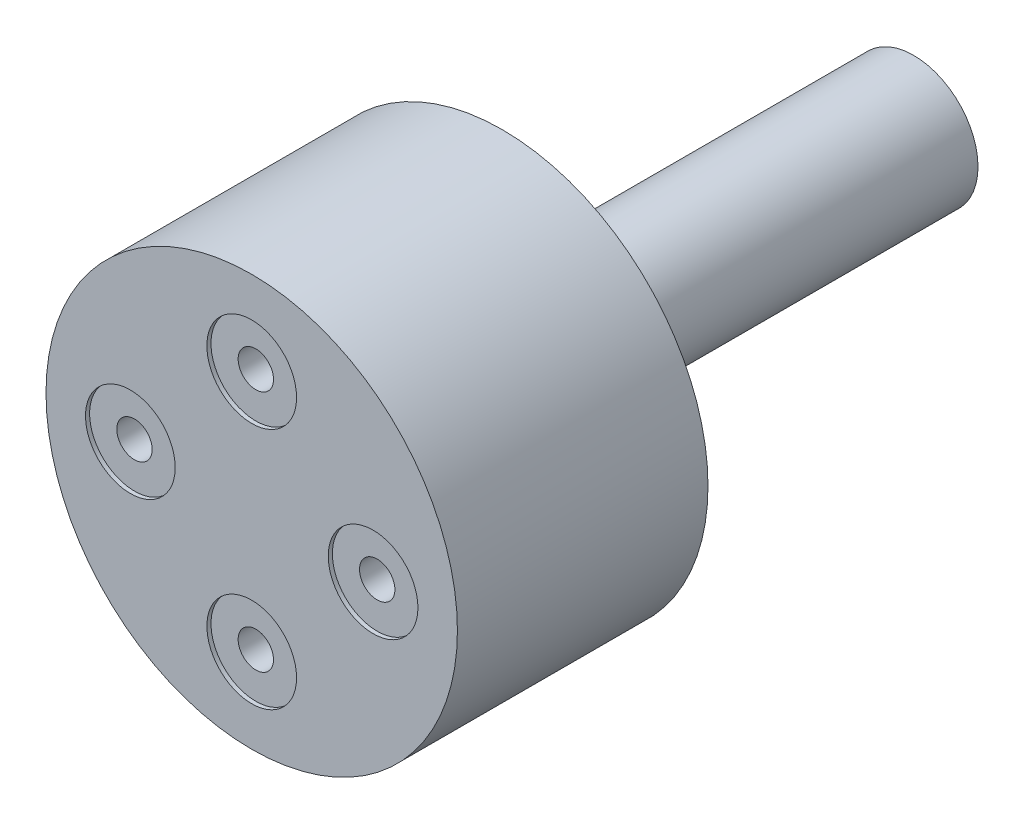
ISO-10303-21;
HEADER;
FILE_DESCRIPTION(('STEP AP214'),'2;1');
FILE_NAME('part.step','',(''),(''),'','','');
FILE_SCHEMA(('AUTOMOTIVE_DESIGN { 1 0 10303 214 1 1 1 1 }'));
ENDSEC;
DATA;
#1=APPLICATION_CONTEXT('core data for automotive mechanical design processes');
#2=APPLICATION_PROTOCOL_DEFINITION('international standard','automotive_design',2000,#1);
#3=PRODUCT_CONTEXT('',#1,'mechanical');
#4=PRODUCT('Part','Part','',(#3));
#5=PRODUCT_RELATED_PRODUCT_CATEGORY('part','',(#4));
#6=PRODUCT_DEFINITION_FORMATION('','',#4);
#7=PRODUCT_DEFINITION_CONTEXT('part definition',#1,'design');
#8=PRODUCT_DEFINITION('design','',#6,#7);
#9=PRODUCT_DEFINITION_SHAPE('','',#8);
#10=(LENGTH_UNIT() NAMED_UNIT(*) SI_UNIT(.MILLI.,.METRE.));
#11=(NAMED_UNIT(*) PLANE_ANGLE_UNIT() SI_UNIT($,.RADIAN.));
#12=(NAMED_UNIT(*) SI_UNIT($,.STERADIAN.) SOLID_ANGLE_UNIT());
#13=UNCERTAINTY_MEASURE_WITH_UNIT(LENGTH_MEASURE(1.E-05),#10,'distance_accuracy_value','');
#14=(GEOMETRIC_REPRESENTATION_CONTEXT(3) GLOBAL_UNCERTAINTY_ASSIGNED_CONTEXT((#13)) GLOBAL_UNIT_ASSIGNED_CONTEXT((#10,
#11,#12)) REPRESENTATION_CONTEXT('',''));
#15=CARTESIAN_POINT('',(0.,0.,0.));
#16=DIRECTION('',(0.,0.,1.));
#17=DIRECTION('',(1.,0.,0.));
#18=AXIS2_PLACEMENT_3D('',#15,#16,#17);
#19=CARTESIAN_POINT('',(0.360795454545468,0.,-20.4343));
#20=DIRECTION('',(0.,0.,1.));
#21=DIRECTION('',(1.,0.,0.));
#22=AXIS2_PLACEMENT_3D('',#19,#20,#21);
#23=PLANE('',#22);
#24=CARTESIAN_POINT('',(0.,0.,-20.4343));
#25=DIRECTION('',(0.,0.,1.));
#26=DIRECTION('',(1.,0.,0.));
#27=AXIS2_PLACEMENT_3D('',#24,#25,#26);
#28=CIRCLE('',#27,3.96875);
#29=CARTESIAN_POINT('',(3.96875,0.,-20.4343));
#30=VERTEX_POINT('',#29);
#31=EDGE_CURVE('E52',#30,#30,#28,.T.);
#32=ORIENTED_EDGE('',*,*,#31,.F.);
#33=EDGE_LOOP('',(#32));
#34=FACE_BOUND('',#33,.T.);
#35=ADVANCED_FACE('F31',(#34),#23,.F.);
#36=CARTESIAN_POINT('',(0.,0.,-20.4343));
#37=DIRECTION('',(0.,0.,1.));
#38=DIRECTION('',(1.,0.,0.));
#39=AXIS2_PLACEMENT_3D('',#36,#37,#38);
#40=CYLINDRICAL_SURFACE('',#39,3.96875);
#41=ORIENTED_EDGE('',*,*,#31,.T.);
#42=EDGE_LOOP('',(#41));
#43=FACE_BOUND('',#42,.T.);
#44=CARTESIAN_POINT('',(0.,0.,4.96569999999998));
#45=DIRECTION('',(0.,0.,1.));
#46=DIRECTION('',(1.,0.,0.));
#47=AXIS2_PLACEMENT_3D('',#44,#45,#46);
#48=CIRCLE('',#47,3.96875);
#49=CARTESIAN_POINT('',(3.96875,0.,4.96569999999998));
#50=VERTEX_POINT('',#49);
#51=EDGE_CURVE('E44',#50,#50,#48,.F.);
#52=ORIENTED_EDGE('',*,*,#51,.T.);
#53=EDGE_LOOP('',(#52));
#54=FACE_BOUND('',#53,.T.);
#55=ADVANCED_FACE('F124',(#43,#54),#40,.T.);
#56=CARTESIAN_POINT('',(1.15454545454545,0.,20.4343));
#57=DIRECTION('',(0.,0.,1.));
#58=DIRECTION('',(1.,0.,0.));
#59=AXIS2_PLACEMENT_3D('',#56,#57,#58);
#60=PLANE('',#59);
#61=CARTESIAN_POINT('',(7.493,0.,20.4343));
#62=DIRECTION('',(0.,0.,1.));
#63=DIRECTION('',(1.,0.,0.));
#64=AXIS2_PLACEMENT_3D('',#61,#62,#63);
#65=CIRCLE('',#64,2.7686);
#66=CARTESIAN_POINT('',(10.2616,0.,20.4343));
#67=VERTEX_POINT('',#66);
#68=EDGE_CURVE('E80',#67,#67,#65,.T.);
#69=ORIENTED_EDGE('',*,*,#68,.F.);
#70=EDGE_LOOP('',(#69));
#71=FACE_BOUND('',#70,.T.);
#72=CARTESIAN_POINT('',(0.,-7.493,20.4343));
#73=DIRECTION('',(0.,0.,1.));
#74=DIRECTION('',(1.,0.,0.));
#75=AXIS2_PLACEMENT_3D('',#72,#73,#74);
#76=CIRCLE('',#75,2.7686);
#77=CARTESIAN_POINT('',(2.7686,-7.493,20.4343));
#78=VERTEX_POINT('',#77);
#79=EDGE_CURVE('E73',#78,#78,#76,.T.);
#80=ORIENTED_EDGE('',*,*,#79,.F.);
#81=EDGE_LOOP('',(#80));
#82=FACE_BOUND('',#81,.T.);
#83=CARTESIAN_POINT('',(-7.493,0.,20.4343));
#84=DIRECTION('',(0.,0.,1.));
#85=DIRECTION('',(1.,0.,0.));
#86=AXIS2_PLACEMENT_3D('',#83,#84,#85);
#87=CIRCLE('',#86,2.7686);
#88=CARTESIAN_POINT('',(-4.7244,0.,20.4343));
#89=VERTEX_POINT('',#88);
#90=EDGE_CURVE('E66',#89,#89,#87,.T.);
#91=ORIENTED_EDGE('',*,*,#90,.F.);
#92=EDGE_LOOP('',(#91));
#93=FACE_BOUND('',#92,.T.);
#94=CARTESIAN_POINT('',(0.,7.493,20.4343));
#95=DIRECTION('',(0.,0.,1.));
#96=DIRECTION('',(1.,0.,0.));
#97=AXIS2_PLACEMENT_3D('',#94,#95,#96);
#98=CIRCLE('',#97,2.7686);
#99=CARTESIAN_POINT('',(2.7686,7.493,20.4343));
#100=VERTEX_POINT('',#99);
#101=EDGE_CURVE('E62',#100,#100,#98,.T.);
#102=ORIENTED_EDGE('',*,*,#101,.F.);
#103=EDGE_LOOP('',(#102));
#104=FACE_BOUND('',#103,.T.);
#105=CARTESIAN_POINT('',(0.,0.,20.4343));
#106=DIRECTION('',(0.,0.,-1.));
#107=DIRECTION('',(-1.,0.,0.));
#108=AXIS2_PLACEMENT_3D('',#105,#106,#107);
#109=CIRCLE('',#108,12.7);
#110=CARTESIAN_POINT('',(-12.7,0.,20.4343));
#111=VERTEX_POINT('',#110);
#112=EDGE_CURVE('E39',#111,#111,#109,.T.);
#113=ORIENTED_EDGE('',*,*,#112,.F.);
#114=EDGE_LOOP('',(#113));
#115=FACE_BOUND('',#114,.T.);
#116=ADVANCED_FACE('F130',(#71,#82,#93,#104,#115),#60,.T.);
#117=CARTESIAN_POINT('',(1.15454545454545,0.,4.96569999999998));
#118=DIRECTION('',(0.,0.,1.));
#119=DIRECTION('',(1.,0.,0.));
#120=AXIS2_PLACEMENT_3D('',#117,#118,#119);
#121=PLANE('',#120);
#122=ORIENTED_EDGE('',*,*,#51,.F.);
#123=EDGE_LOOP('',(#122));
#124=FACE_BOUND('',#123,.T.);
#125=CARTESIAN_POINT('',(0.,0.,4.9657));
#126=DIRECTION('',(0.,0.,-1.));
#127=DIRECTION('',(-1.,0.,0.));
#128=AXIS2_PLACEMENT_3D('',#125,#126,#127);
#129=CIRCLE('',#128,12.7);
#130=CARTESIAN_POINT('',(-12.7,0.,4.9657));
#131=VERTEX_POINT('',#130);
#132=EDGE_CURVE('E10',#131,#131,#129,.F.);
#133=ORIENTED_EDGE('',*,*,#132,.F.);
#134=EDGE_LOOP('',(#133));
#135=FACE_BOUND('',#134,.T.);
#136=ADVANCED_FACE('F120',(#124,#135),#121,.F.);
#137=CARTESIAN_POINT('',(0.,0.,20.4343));
#138=DIRECTION('',(0.,0.,-1.));
#139=DIRECTION('',(-1.,0.,0.));
#140=AXIS2_PLACEMENT_3D('',#137,#138,#139);
#141=CYLINDRICAL_SURFACE('',#140,12.7);
#142=ORIENTED_EDGE('',*,*,#112,.T.);
#143=EDGE_LOOP('',(#142));
#144=FACE_BOUND('',#143,.T.);
#145=ORIENTED_EDGE('',*,*,#132,.T.);
#146=EDGE_LOOP('',(#145));
#147=FACE_BOUND('',#146,.T.);
#148=ADVANCED_FACE('F33',(#144,#147),#141,.T.);
#149=CARTESIAN_POINT('',(0.,7.493,20.1803));
#150=DIRECTION('',(0.,0.,1.));
#151=DIRECTION('',(1.,0.,0.));
#152=AXIS2_PLACEMENT_3D('',#149,#150,#151);
#153=PLANE('',#152);
#154=CARTESIAN_POINT('',(0.,7.493,20.1803));
#155=DIRECTION('',(0.,0.,1.));
#156=DIRECTION('',(1.,0.,0.));
#157=AXIS2_PLACEMENT_3D('',#154,#155,#156);
#158=CIRCLE('',#157,2.7686);
#159=CARTESIAN_POINT('',(2.7686,7.493,20.1803));
#160=VERTEX_POINT('',#159);
#161=EDGE_CURVE('E59',#160,#160,#158,.T.);
#162=ORIENTED_EDGE('',*,*,#161,.T.);
#163=EDGE_LOOP('',(#162));
#164=FACE_BOUND('',#163,.T.);
#165=CARTESIAN_POINT('',(0.,7.493,20.1803));
#166=DIRECTION('',(0.,0.,1.));
#167=DIRECTION('',(1.,0.,0.));
#168=AXIS2_PLACEMENT_3D('',#165,#166,#167);
#169=CIRCLE('',#168,1.0922);
#170=CARTESIAN_POINT('',(1.0922,7.493,20.1803));
#171=VERTEX_POINT('',#170);
#172=EDGE_CURVE('E55',#171,#171,#169,.F.);
#173=ORIENTED_EDGE('',*,*,#172,.T.);
#174=EDGE_LOOP('',(#173));
#175=FACE_BOUND('',#174,.T.);
#176=ADVANCED_FACE('F109',(#164,#175),#153,.T.);
#177=CARTESIAN_POINT('',(0.,7.493,20.1803));
#178=DIRECTION('',(0.,0.,1.));
#179=DIRECTION('',(1.,0.,0.));
#180=AXIS2_PLACEMENT_3D('',#177,#178,#179);
#181=CYLINDRICAL_SURFACE('',#180,2.7686);
#182=ORIENTED_EDGE('',*,*,#161,.F.);
#183=EDGE_LOOP('',(#182));
#184=FACE_BOUND('',#183,.T.);
#185=ORIENTED_EDGE('',*,*,#101,.T.);
#186=EDGE_LOOP('',(#185));
#187=FACE_BOUND('',#186,.T.);
#188=ADVANCED_FACE('F111',(#184,#187),#181,.F.);
#189=CARTESIAN_POINT('',(0.,7.493,14.0843));
#190=DIRECTION('',(0.,0.,1.));
#191=DIRECTION('',(1.,0.,0.));
#192=AXIS2_PLACEMENT_3D('',#189,#190,#191);
#193=PLANE('',#192);
#194=CARTESIAN_POINT('',(0.,7.493,14.0843));
#195=DIRECTION('',(0.,0.,1.));
#196=DIRECTION('',(1.,0.,0.));
#197=AXIS2_PLACEMENT_3D('',#194,#195,#196);
#198=CIRCLE('',#197,1.0922);
#199=CARTESIAN_POINT('',(1.0922,7.493,14.0843));
#200=VERTEX_POINT('',#199);
#201=EDGE_CURVE('E47',#200,#200,#198,.T.);
#202=ORIENTED_EDGE('',*,*,#201,.T.);
#203=EDGE_LOOP('',(#202));
#204=FACE_BOUND('',#203,.T.);
#205=ADVANCED_FACE('F100',(#204),#193,.T.);
#206=CARTESIAN_POINT('',(0.,7.493,14.0843));
#207=DIRECTION('',(0.,0.,1.));
#208=DIRECTION('',(1.,0.,0.));
#209=AXIS2_PLACEMENT_3D('',#206,#207,#208);
#210=CYLINDRICAL_SURFACE('',#209,1.0922);
#211=ORIENTED_EDGE('',*,*,#201,.F.);
#212=EDGE_LOOP('',(#211));
#213=FACE_BOUND('',#212,.T.);
#214=ORIENTED_EDGE('',*,*,#172,.F.);
#215=EDGE_LOOP('',(#214));
#216=FACE_BOUND('',#215,.T.);
#217=ADVANCED_FACE('F102',(#213,#216),#210,.F.);
#218=CARTESIAN_POINT('',(-7.493,0.,20.1803));
#219=DIRECTION('',(0.,0.,1.));
#220=DIRECTION('',(1.,0.,0.));
#221=AXIS2_PLACEMENT_3D('',#218,#219,#220);
#222=PLANE('',#221);
#223=CARTESIAN_POINT('',(-7.493,0.,20.1803));
#224=DIRECTION('',(0.,0.,1.));
#225=DIRECTION('',(1.,0.,0.));
#226=AXIS2_PLACEMENT_3D('',#223,#224,#225);
#227=CIRCLE('',#226,2.7686);
#228=CARTESIAN_POINT('',(-4.7244,0.,20.1803));
#229=VERTEX_POINT('',#228);
#230=EDGE_CURVE('E63',#229,#229,#227,.T.);
#231=ORIENTED_EDGE('',*,*,#230,.T.);
#232=EDGE_LOOP('',(#231));
#233=FACE_BOUND('',#232,.T.);
#234=CARTESIAN_POINT('',(-7.493,0.,20.1803));
#235=DIRECTION('',(0.,0.,1.));
#236=DIRECTION('',(1.,0.,0.));
#237=AXIS2_PLACEMENT_3D('',#234,#235,#236);
#238=CIRCLE('',#237,1.0922);
#239=CARTESIAN_POINT('',(-6.4008,0.,20.1803));
#240=VERTEX_POINT('',#239);
#241=EDGE_CURVE('E60',#240,#240,#238,.F.);
#242=ORIENTED_EDGE('',*,*,#241,.T.);
#243=EDGE_LOOP('',(#242));
#244=FACE_BOUND('',#243,.T.);
#245=ADVANCED_FACE('F105',(#233,#244),#222,.T.);
#246=CARTESIAN_POINT('',(-7.493,0.,20.1803));
#247=DIRECTION('',(0.,0.,1.));
#248=DIRECTION('',(1.,0.,0.));
#249=AXIS2_PLACEMENT_3D('',#246,#247,#248);
#250=CYLINDRICAL_SURFACE('',#249,2.7686);
#251=ORIENTED_EDGE('',*,*,#230,.F.);
#252=EDGE_LOOP('',(#251));
#253=FACE_BOUND('',#252,.T.);
#254=ORIENTED_EDGE('',*,*,#90,.T.);
#255=EDGE_LOOP('',(#254));
#256=FACE_BOUND('',#255,.T.);
#257=ADVANCED_FACE('F200',(#253,#256),#250,.F.);
#258=CARTESIAN_POINT('',(-7.493,0.,14.0843));
#259=DIRECTION('',(0.,0.,-1.));
#260=DIRECTION('',(-1.,0.,0.));
#261=AXIS2_PLACEMENT_3D('',#258,#259,#260);
#262=PLANE('',#261);
#263=CARTESIAN_POINT('',(-7.493,0.,14.0843));
#264=DIRECTION('',(0.,0.,1.));
#265=DIRECTION('',(-1.,0.,0.));
#266=AXIS2_PLACEMENT_3D('',#263,#264,#265);
#267=CIRCLE('',#266,1.0922);
#268=CARTESIAN_POINT('',(-8.5852,0.,14.0843));
#269=VERTEX_POINT('',#268);
#270=EDGE_CURVE('E58',#269,#269,#267,.T.);
#271=ORIENTED_EDGE('',*,*,#270,.T.);
#272=EDGE_LOOP('',(#271));
#273=FACE_BOUND('',#272,.T.);
#274=ADVANCED_FACE('F196',(#273),#262,.F.);
#275=CARTESIAN_POINT('',(-7.493,0.,14.0843));
#276=DIRECTION('',(0.,0.,1.));
#277=DIRECTION('',(1.,0.,0.));
#278=AXIS2_PLACEMENT_3D('',#275,#276,#277);
#279=CYLINDRICAL_SURFACE('',#278,1.0922);
#280=ORIENTED_EDGE('',*,*,#270,.F.);
#281=EDGE_LOOP('',(#280));
#282=FACE_BOUND('',#281,.T.);
#283=ORIENTED_EDGE('',*,*,#241,.F.);
#284=EDGE_LOOP('',(#283));
#285=FACE_BOUND('',#284,.T.);
#286=ADVANCED_FACE('F199',(#282,#285),#279,.F.);
#287=CARTESIAN_POINT('',(0.,-7.493,20.1803));
#288=DIRECTION('',(0.,0.,1.));
#289=DIRECTION('',(1.,0.,0.));
#290=AXIS2_PLACEMENT_3D('',#287,#288,#289);
#291=PLANE('',#290);
#292=CARTESIAN_POINT('',(0.,-7.493,20.1803));
#293=DIRECTION('',(0.,0.,1.));
#294=DIRECTION('',(1.,0.,0.));
#295=AXIS2_PLACEMENT_3D('',#292,#293,#294);
#296=CIRCLE('',#295,2.7686);
#297=CARTESIAN_POINT('',(2.7686,-7.493,20.1803));
#298=VERTEX_POINT('',#297);
#299=EDGE_CURVE('E67',#298,#298,#296,.T.);
#300=ORIENTED_EDGE('',*,*,#299,.T.);
#301=EDGE_LOOP('',(#300));
#302=FACE_BOUND('',#301,.T.);
#303=CARTESIAN_POINT('',(0.,-7.493,20.1803));
#304=DIRECTION('',(0.,0.,1.));
#305=DIRECTION('',(1.,0.,0.));
#306=AXIS2_PLACEMENT_3D('',#303,#304,#305);
#307=CIRCLE('',#306,1.0922);
#308=CARTESIAN_POINT('',(1.0922,-7.493,20.1803));
#309=VERTEX_POINT('',#308);
#310=EDGE_CURVE('E64',#309,#309,#307,.F.);
#311=ORIENTED_EDGE('',*,*,#310,.T.);
#312=EDGE_LOOP('',(#311));
#313=FACE_BOUND('',#312,.T.);
#314=ADVANCED_FACE('F250',(#302,#313),#291,.T.);
#315=CARTESIAN_POINT('',(0.,-7.493,20.1803));
#316=DIRECTION('',(0.,0.,1.));
#317=DIRECTION('',(1.,0.,0.));
#318=AXIS2_PLACEMENT_3D('',#315,#316,#317);
#319=CYLINDRICAL_SURFACE('',#318,2.7686);
#320=ORIENTED_EDGE('',*,*,#299,.F.);
#321=EDGE_LOOP('',(#320));
#322=FACE_BOUND('',#321,.T.);
#323=ORIENTED_EDGE('',*,*,#79,.T.);
#324=EDGE_LOOP('',(#323));
#325=FACE_BOUND('',#324,.T.);
#326=ADVANCED_FACE('F187',(#322,#325),#319,.F.);
#327=CARTESIAN_POINT('',(0.,-7.493,14.0843));
#328=DIRECTION('',(0.,0.,-1.));
#329=DIRECTION('',(-1.,0.,0.));
#330=AXIS2_PLACEMENT_3D('',#327,#328,#329);
#331=PLANE('',#330);
#332=CARTESIAN_POINT('',(0.,-7.493,14.0843));
#333=DIRECTION('',(0.,0.,1.));
#334=DIRECTION('',(-1.,0.,0.));
#335=AXIS2_PLACEMENT_3D('',#332,#333,#334);
#336=CIRCLE('',#335,1.0922);
#337=CARTESIAN_POINT('',(-1.0922,-7.493,14.0843));
#338=VERTEX_POINT('',#337);
#339=EDGE_CURVE('E91',#338,#338,#336,.T.);
#340=ORIENTED_EDGE('',*,*,#339,.T.);
#341=EDGE_LOOP('',(#340));
#342=FACE_BOUND('',#341,.T.);
#343=ADVANCED_FACE('F182',(#342),#331,.F.);
#344=CARTESIAN_POINT('',(0.,-7.493,14.0843));
#345=DIRECTION('',(0.,0.,1.));
#346=DIRECTION('',(1.,0.,0.));
#347=AXIS2_PLACEMENT_3D('',#344,#345,#346);
#348=CYLINDRICAL_SURFACE('',#347,1.0922);
#349=ORIENTED_EDGE('',*,*,#339,.F.);
#350=EDGE_LOOP('',(#349));
#351=FACE_BOUND('',#350,.T.);
#352=ORIENTED_EDGE('',*,*,#310,.F.);
#353=EDGE_LOOP('',(#352));
#354=FACE_BOUND('',#353,.T.);
#355=ADVANCED_FACE('F186',(#351,#354),#348,.F.);
#356=CARTESIAN_POINT('',(7.493,0.,20.1803));
#357=DIRECTION('',(0.,0.,1.));
#358=DIRECTION('',(1.,0.,0.));
#359=AXIS2_PLACEMENT_3D('',#356,#357,#358);
#360=PLANE('',#359);
#361=CARTESIAN_POINT('',(7.493,0.,20.1803));
#362=DIRECTION('',(0.,0.,1.));
#363=DIRECTION('',(1.,0.,0.));
#364=AXIS2_PLACEMENT_3D('',#361,#362,#363);
#365=CIRCLE('',#364,2.7686);
#366=CARTESIAN_POINT('',(10.2616,0.,20.1803));
#367=VERTEX_POINT('',#366);
#368=EDGE_CURVE('E307',#367,#367,#365,.T.);
#369=ORIENTED_EDGE('',*,*,#368,.T.);
#370=EDGE_LOOP('',(#369));
#371=FACE_BOUND('',#370,.T.);
#372=CARTESIAN_POINT('',(7.493,0.,20.1803));
#373=DIRECTION('',(0.,0.,1.));
#374=DIRECTION('',(1.,0.,0.));
#375=AXIS2_PLACEMENT_3D('',#372,#373,#374);
#376=CIRCLE('',#375,1.0922);
#377=CARTESIAN_POINT('',(8.5852,0.,20.1803));
#378=VERTEX_POINT('',#377);
#379=EDGE_CURVE('E35',#378,#378,#376,.F.);
#380=ORIENTED_EDGE('',*,*,#379,.T.);
#381=EDGE_LOOP('',(#380));
#382=FACE_BOUND('',#381,.T.);
#383=ADVANCED_FACE('F275',(#371,#382),#360,.T.);
#384=CARTESIAN_POINT('',(7.493,0.,20.1803));
#385=DIRECTION('',(0.,0.,1.));
#386=DIRECTION('',(1.,0.,0.));
#387=AXIS2_PLACEMENT_3D('',#384,#385,#386);
#388=CYLINDRICAL_SURFACE('',#387,2.7686);
#389=ORIENTED_EDGE('',*,*,#368,.F.);
#390=EDGE_LOOP('',(#389));
#391=FACE_BOUND('',#390,.T.);
#392=ORIENTED_EDGE('',*,*,#68,.T.);
#393=EDGE_LOOP('',(#392));
#394=FACE_BOUND('',#393,.T.);
#395=ADVANCED_FACE('F174',(#391,#394),#388,.F.);
#396=CARTESIAN_POINT('',(7.493,0.,14.0843));
#397=DIRECTION('',(0.,0.,1.));
#398=DIRECTION('',(1.,0.,0.));
#399=AXIS2_PLACEMENT_3D('',#396,#397,#398);
#400=PLANE('',#399);
#401=CARTESIAN_POINT('',(7.493,0.,14.0843));
#402=DIRECTION('',(0.,0.,1.));
#403=DIRECTION('',(1.,0.,0.));
#404=AXIS2_PLACEMENT_3D('',#401,#402,#403);
#405=CIRCLE('',#404,1.0922);
#406=CARTESIAN_POINT('',(8.5852,0.,14.0843));
#407=VERTEX_POINT('',#406);
#408=EDGE_CURVE('E93',#407,#407,#405,.T.);
#409=ORIENTED_EDGE('',*,*,#408,.T.);
#410=EDGE_LOOP('',(#409));
#411=FACE_BOUND('',#410,.T.);
#412=ADVANCED_FACE('F169',(#411),#400,.T.);
#413=CARTESIAN_POINT('',(7.493,0.,14.0843));
#414=DIRECTION('',(0.,0.,1.));
#415=DIRECTION('',(1.,0.,0.));
#416=AXIS2_PLACEMENT_3D('',#413,#414,#415);
#417=CYLINDRICAL_SURFACE('',#416,1.0922);
#418=ORIENTED_EDGE('',*,*,#408,.F.);
#419=EDGE_LOOP('',(#418));
#420=FACE_BOUND('',#419,.T.);
#421=ORIENTED_EDGE('',*,*,#379,.F.);
#422=EDGE_LOOP('',(#421));
#423=FACE_BOUND('',#422,.T.);
#424=ADVANCED_FACE('F173',(#420,#423),#417,.F.);
#425=CLOSED_SHELL('',(#35,#55,#116,#136,#148,#176,#188,#205,#217,#245,#257,#274,#286,#314,#326,
#343,#355,#383,#395,#412,#424));
#426=MANIFOLD_SOLID_BREP('B2',#425);
#427=ADVANCED_BREP_SHAPE_REPRESENTATION('',(#18,#426),#14);
#428=SHAPE_DEFINITION_REPRESENTATION(#9,#427);
ENDSEC;
END-ISO-10303-21;
